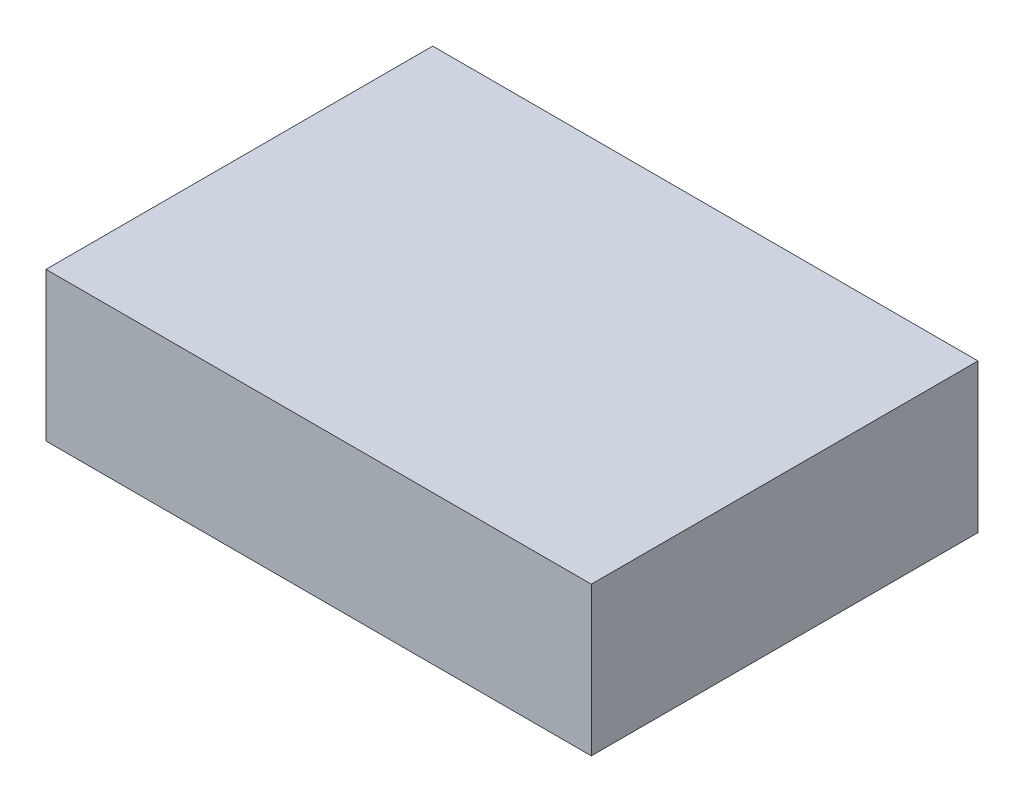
ISO-10303-21;
HEADER;
FILE_DESCRIPTION(('STEP AP214'),'2;1');
FILE_NAME('part.step','',(''),(''),'','','');
FILE_SCHEMA(('AUTOMOTIVE_DESIGN { 1 0 10303 214 1 1 1 1 }'));
ENDSEC;
DATA;
#1=APPLICATION_CONTEXT('core data for automotive mechanical design processes');
#2=APPLICATION_PROTOCOL_DEFINITION('international standard','automotive_design',2000,#1);
#3=PRODUCT_CONTEXT('',#1,'mechanical');
#4=PRODUCT('Part','Part','',(#3));
#5=PRODUCT_RELATED_PRODUCT_CATEGORY('part','',(#4));
#6=PRODUCT_DEFINITION_FORMATION('','',#4);
#7=PRODUCT_DEFINITION_CONTEXT('part definition',#1,'design');
#8=PRODUCT_DEFINITION('design','',#6,#7);
#9=PRODUCT_DEFINITION_SHAPE('','',#8);
#10=(LENGTH_UNIT() NAMED_UNIT(*) SI_UNIT(.MILLI.,.METRE.));
#11=(NAMED_UNIT(*) PLANE_ANGLE_UNIT() SI_UNIT($,.RADIAN.));
#12=(NAMED_UNIT(*) SI_UNIT($,.STERADIAN.) SOLID_ANGLE_UNIT());
#13=UNCERTAINTY_MEASURE_WITH_UNIT(LENGTH_MEASURE(1.E-05),#10,'distance_accuracy_value','');
#14=(GEOMETRIC_REPRESENTATION_CONTEXT(3) GLOBAL_UNCERTAINTY_ASSIGNED_CONTEXT((#13)) GLOBAL_UNIT_ASSIGNED_CONTEXT((#10,
#11,#12)) REPRESENTATION_CONTEXT('',''));
#15=CARTESIAN_POINT('',(0.,0.,0.));
#16=DIRECTION('',(0.,0.,1.));
#17=DIRECTION('',(1.,0.,0.));
#18=AXIS2_PLACEMENT_3D('',#15,#16,#17);
#19=CARTESIAN_POINT('',(27.5,15.,-19.5));
#20=DIRECTION('',(-1.,0.,0.));
#21=DIRECTION('',(0.,0.,1.));
#22=AXIS2_PLACEMENT_3D('',#19,#20,#21);
#23=PLANE('',#22);
#24=DIRECTION('',(0.,0.,-1.));
#25=VECTOR('',#24,1.);
#26=CARTESIAN_POINT('',(27.5,0.,-19.5));
#27=LINE('',#26,#25);
#28=CARTESIAN_POINT('',(27.5,0.,19.5));
#29=VERTEX_POINT('',#28);
#30=CARTESIAN_POINT('',(27.5,0.,-19.5));
#31=VERTEX_POINT('',#30);
#32=EDGE_CURVE('E98',#29,#31,#27,.T.);
#33=ORIENTED_EDGE('',*,*,#32,.T.);
#34=DIRECTION('',(0.,-1.,0.));
#35=VECTOR('',#34,1.);
#36=CARTESIAN_POINT('',(27.5,15.,-19.5));
#37=LINE('',#36,#35);
#38=CARTESIAN_POINT('',(27.5,15.,-19.5));
#39=VERTEX_POINT('',#38);
#40=EDGE_CURVE('E11',#39,#31,#37,.T.);
#41=ORIENTED_EDGE('',*,*,#40,.F.);
#42=DIRECTION('',(0.,0.,-1.));
#43=VECTOR('',#42,1.);
#44=CARTESIAN_POINT('',(27.5,15.,-19.5));
#45=LINE('',#44,#43);
#46=CARTESIAN_POINT('',(27.5,15.,19.5));
#47=VERTEX_POINT('',#46);
#48=EDGE_CURVE('E86',#47,#39,#45,.T.);
#49=ORIENTED_EDGE('',*,*,#48,.F.);
#50=DIRECTION('',(0.,-1.,0.));
#51=VECTOR('',#50,1.);
#52=CARTESIAN_POINT('',(27.5,15.,19.5));
#53=LINE('',#52,#51);
#54=EDGE_CURVE('E94',#47,#29,#53,.T.);
#55=ORIENTED_EDGE('',*,*,#54,.T.);
#56=EDGE_LOOP('',(#33,#41,#49,#55));
#57=FACE_BOUND('',#56,.T.);
#58=ADVANCED_FACE('F35',(#57),#23,.F.);
#59=CARTESIAN_POINT('',(-27.5,15.,-19.5));
#60=DIRECTION('',(0.,0.,1.));
#61=DIRECTION('',(1.,0.,0.));
#62=AXIS2_PLACEMENT_3D('',#59,#60,#61);
#63=PLANE('',#62);
#64=DIRECTION('',(-1.,0.,0.));
#65=VECTOR('',#64,1.);
#66=CARTESIAN_POINT('',(-27.5,0.,-19.5));
#67=LINE('',#66,#65);
#68=CARTESIAN_POINT('',(-27.5,0.,-19.5));
#69=VERTEX_POINT('',#68);
#70=EDGE_CURVE('E90',#31,#69,#67,.T.);
#71=ORIENTED_EDGE('',*,*,#70,.T.);
#72=DIRECTION('',(0.,-1.,0.));
#73=VECTOR('',#72,1.);
#74=CARTESIAN_POINT('',(-27.5,15.,-19.5));
#75=LINE('',#74,#73);
#76=CARTESIAN_POINT('',(-27.5,15.,-19.5));
#77=VERTEX_POINT('',#76);
#78=EDGE_CURVE('E43',#77,#69,#75,.T.);
#79=ORIENTED_EDGE('',*,*,#78,.F.);
#80=DIRECTION('',(-1.,0.,0.));
#81=VECTOR('',#80,1.);
#82=CARTESIAN_POINT('',(-27.5,15.,-19.5));
#83=LINE('',#82,#81);
#84=EDGE_CURVE('E81',#39,#77,#83,.T.);
#85=ORIENTED_EDGE('',*,*,#84,.F.);
#86=ORIENTED_EDGE('',*,*,#40,.T.);
#87=EDGE_LOOP('',(#71,#79,#85,#86));
#88=FACE_BOUND('',#87,.T.);
#89=ADVANCED_FACE('F89',(#88),#63,.F.);
#90=CARTESIAN_POINT('',(-27.5,15.,-19.5));
#91=DIRECTION('',(1.,0.,0.));
#92=DIRECTION('',(0.,0.,-1.));
#93=AXIS2_PLACEMENT_3D('',#90,#91,#92);
#94=PLANE('',#93);
#95=DIRECTION('',(0.,0.,1.));
#96=VECTOR('',#95,1.);
#97=CARTESIAN_POINT('',(-27.5,0.,-19.5));
#98=LINE('',#97,#96);
#99=CARTESIAN_POINT('',(-27.5,0.,19.5));
#100=VERTEX_POINT('',#99);
#101=EDGE_CURVE('E68',#69,#100,#98,.T.);
#102=ORIENTED_EDGE('',*,*,#101,.T.);
#103=DIRECTION('',(0.,-1.,0.));
#104=VECTOR('',#103,1.);
#105=CARTESIAN_POINT('',(-27.5,15.,19.5));
#106=LINE('',#105,#104);
#107=CARTESIAN_POINT('',(-27.5,15.,19.5));
#108=VERTEX_POINT('',#107);
#109=EDGE_CURVE('E91',#108,#100,#106,.T.);
#110=ORIENTED_EDGE('',*,*,#109,.F.);
#111=DIRECTION('',(0.,0.,1.));
#112=VECTOR('',#111,1.);
#113=CARTESIAN_POINT('',(-27.5,15.,-19.5));
#114=LINE('',#113,#112);
#115=EDGE_CURVE('E84',#77,#108,#114,.T.);
#116=ORIENTED_EDGE('',*,*,#115,.F.);
#117=ORIENTED_EDGE('',*,*,#78,.T.);
#118=EDGE_LOOP('',(#102,#110,#116,#117));
#119=FACE_BOUND('',#118,.T.);
#120=ADVANCED_FACE('F92',(#119),#94,.F.);
#121=CARTESIAN_POINT('',(-27.5,15.,19.5));
#122=DIRECTION('',(0.,0.,-1.));
#123=DIRECTION('',(-1.,0.,0.));
#124=AXIS2_PLACEMENT_3D('',#121,#122,#123);
#125=PLANE('',#124);
#126=DIRECTION('',(1.,0.,0.));
#127=VECTOR('',#126,1.);
#128=CARTESIAN_POINT('',(-27.5,0.,19.5));
#129=LINE('',#128,#127);
#130=EDGE_CURVE('E74',#100,#29,#129,.T.);
#131=ORIENTED_EDGE('',*,*,#130,.T.);
#132=ORIENTED_EDGE('',*,*,#54,.F.);
#133=DIRECTION('',(1.,0.,0.));
#134=VECTOR('',#133,1.);
#135=CARTESIAN_POINT('',(-27.5,15.,19.5));
#136=LINE('',#135,#134);
#137=EDGE_CURVE('E51',#108,#47,#136,.T.);
#138=ORIENTED_EDGE('',*,*,#137,.F.);
#139=ORIENTED_EDGE('',*,*,#109,.T.);
#140=EDGE_LOOP('',(#131,#132,#138,#139));
#141=FACE_BOUND('',#140,.T.);
#142=ADVANCED_FACE('F105',(#141),#125,.F.);
#143=CARTESIAN_POINT('',(0.,15.,0.));
#144=DIRECTION('',(0.,1.,0.));
#145=DIRECTION('',(0.,0.,1.));
#146=AXIS2_PLACEMENT_3D('',#143,#144,#145);
#147=PLANE('',#146);
#148=ORIENTED_EDGE('',*,*,#48,.T.);
#149=ORIENTED_EDGE('',*,*,#84,.T.);
#150=ORIENTED_EDGE('',*,*,#115,.T.);
#151=ORIENTED_EDGE('',*,*,#137,.T.);
#152=EDGE_LOOP('',(#148,#149,#150,#151));
#153=FACE_BOUND('',#152,.T.);
#154=ADVANCED_FACE('F82',(#153),#147,.T.);
#155=CARTESIAN_POINT('',(0.,0.,0.));
#156=DIRECTION('',(0.,1.,0.));
#157=DIRECTION('',(0.,0.,1.));
#158=AXIS2_PLACEMENT_3D('',#155,#156,#157);
#159=PLANE('',#158);
#160=ORIENTED_EDGE('',*,*,#32,.F.);
#161=ORIENTED_EDGE('',*,*,#130,.F.);
#162=ORIENTED_EDGE('',*,*,#101,.F.);
#163=ORIENTED_EDGE('',*,*,#70,.F.);
#164=EDGE_LOOP('',(#160,#161,#162,#163));
#165=FACE_BOUND('',#164,.T.);
#166=ADVANCED_FACE('F108',(#165),#159,.F.);
#167=CLOSED_SHELL('',(#58,#89,#120,#142,#154,#166));
#168=MANIFOLD_SOLID_BREP('B2',#167);
#169=ADVANCED_BREP_SHAPE_REPRESENTATION('',(#18,#168),#14);
#170=SHAPE_DEFINITION_REPRESENTATION(#9,#169);
ENDSEC;
END-ISO-10303-21;
